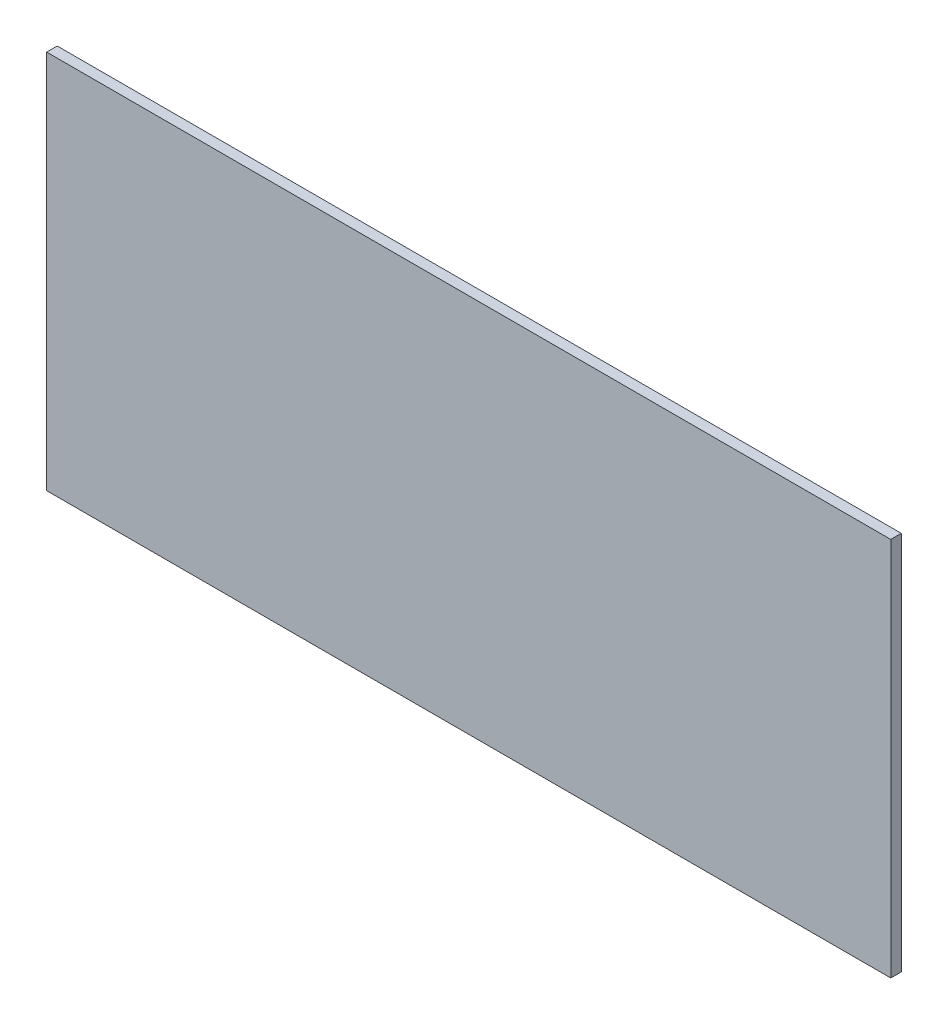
from build123d import *

# Parameters (mm, degrees)
SKETCH1_W           = 254
SKETCH1_H           = 114.3
BOSS_EXTRUDE1_DEPTH = 3.175


with BuildPart() as part:
    # Sketch1 → Boss-Extrude1 (new body)
    with BuildSketch(Plane.XY):
        with Locations((127, 57.15)):
            Rectangle(SKETCH1_W, SKETCH1_H)
    extrude(amount=BOSS_EXTRUDE1_DEPTH)


solid = part.part
